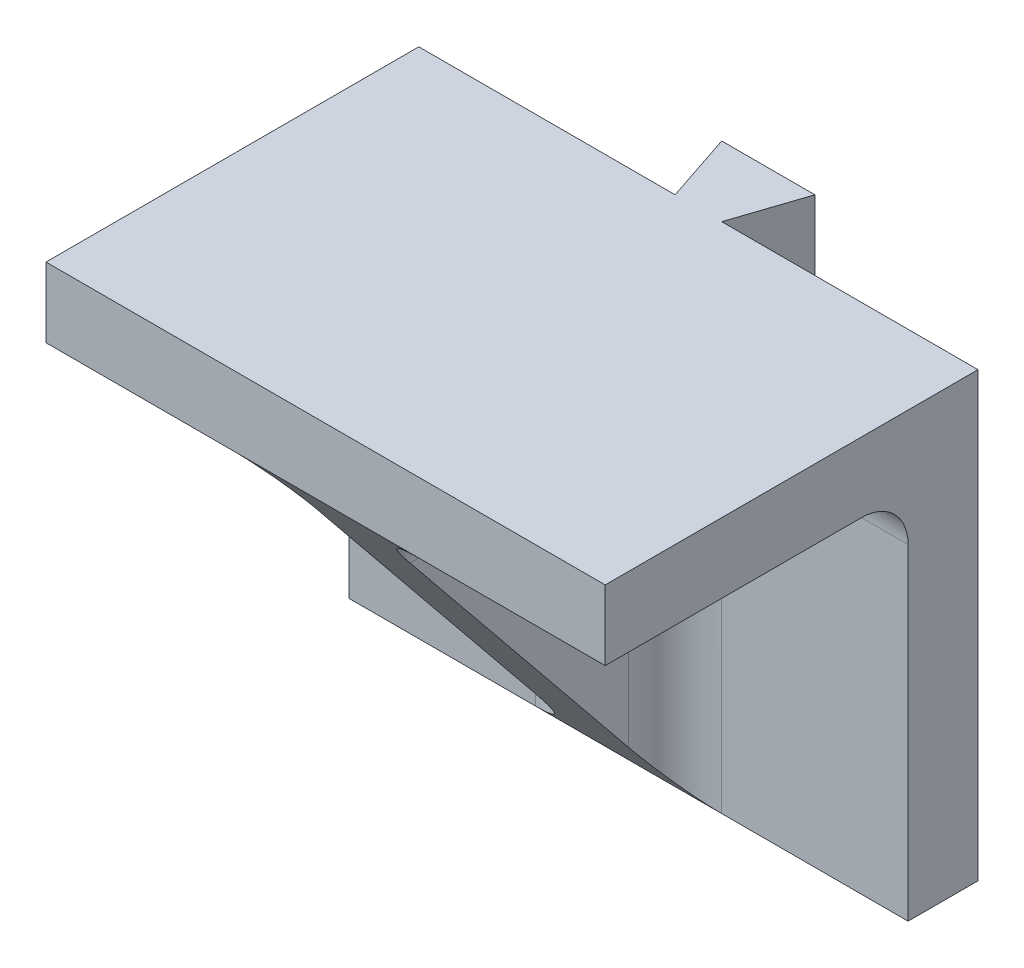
ISO-10303-21;
HEADER;
FILE_DESCRIPTION(('STEP AP214'),'2;1');
FILE_NAME('part.step','',(''),(''),'','','');
FILE_SCHEMA(('AUTOMOTIVE_DESIGN { 1 0 10303 214 1 1 1 1 }'));
ENDSEC;
DATA;
#1=APPLICATION_CONTEXT('core data for automotive mechanical design processes');
#2=APPLICATION_PROTOCOL_DEFINITION('international standard','automotive_design',2000,#1);
#3=PRODUCT_CONTEXT('',#1,'mechanical');
#4=PRODUCT('Part','Part','',(#3));
#5=PRODUCT_RELATED_PRODUCT_CATEGORY('part','',(#4));
#6=PRODUCT_DEFINITION_FORMATION('','',#4);
#7=PRODUCT_DEFINITION_CONTEXT('part definition',#1,'design');
#8=PRODUCT_DEFINITION('design','',#6,#7);
#9=PRODUCT_DEFINITION_SHAPE('','',#8);
#10=(LENGTH_UNIT() NAMED_UNIT(*) SI_UNIT(.MILLI.,.METRE.));
#11=(NAMED_UNIT(*) PLANE_ANGLE_UNIT() SI_UNIT($,.RADIAN.));
#12=(NAMED_UNIT(*) SI_UNIT($,.STERADIAN.) SOLID_ANGLE_UNIT());
#13=UNCERTAINTY_MEASURE_WITH_UNIT(LENGTH_MEASURE(1.E-05),#10,'distance_accuracy_value','');
#14=(GEOMETRIC_REPRESENTATION_CONTEXT(3) GLOBAL_UNCERTAINTY_ASSIGNED_CONTEXT((#13)) GLOBAL_UNIT_ASSIGNED_CONTEXT((#10,
#11,#12)) REPRESENTATION_CONTEXT('',''));
#15=CARTESIAN_POINT('',(0.,0.,0.));
#16=DIRECTION('',(0.,0.,1.));
#17=DIRECTION('',(1.,0.,0.));
#18=AXIS2_PLACEMENT_3D('',#15,#16,#17);
#19=CARTESIAN_POINT('',(-76.2,-19.05,0.));
#20=DIRECTION('',(0.,1.,0.));
#21=DIRECTION('',(0.,0.,1.));
#22=AXIS2_PLACEMENT_3D('',#19,#20,#21);
#23=PLANE('',#22);
#24=DIRECTION('',(1.,0.,0.));
#25=VECTOR('',#24,1.);
#26=CARTESIAN_POINT('',(-76.2,-19.05,101.6));
#27=LINE('',#26,#25);
#28=CARTESIAN_POINT('',(25.4,-19.05,101.6));
#29=VERTEX_POINT('',#28);
#30=CARTESIAN_POINT('',(76.2,-19.05,101.6));
#31=VERTEX_POINT('',#30);
#32=EDGE_CURVE('E213',#29,#31,#27,.T.);
#33=ORIENTED_EDGE('',*,*,#32,.F.);
#34=DIRECTION('',(0.,0.,1.));
#35=VECTOR('',#34,1.);
#36=CARTESIAN_POINT('',(25.4,-19.05,31.75));
#37=LINE('',#36,#35);
#38=CARTESIAN_POINT('',(25.4,-19.05,31.75));
#39=VERTEX_POINT('',#38);
#40=EDGE_CURVE('E268',#29,#39,#37,.F.);
#41=ORIENTED_EDGE('',*,*,#40,.T.);
#42=DIRECTION('',(1.,0.,0.));
#43=VECTOR('',#42,1.);
#44=CARTESIAN_POINT('',(-76.2,-19.05,31.75));
#45=LINE('',#44,#43);
#46=CARTESIAN_POINT('',(76.2,-19.05,31.75));
#47=VERTEX_POINT('',#46);
#48=EDGE_CURVE('E221',#39,#47,#45,.T.);
#49=ORIENTED_EDGE('',*,*,#48,.T.);
#50=DIRECTION('',(0.,0.,-1.));
#51=VECTOR('',#50,1.);
#52=CARTESIAN_POINT('',(76.2,-19.05,0.));
#53=LINE('',#52,#51);
#54=EDGE_CURVE('E232',#31,#47,#53,.T.);
#55=ORIENTED_EDGE('',*,*,#54,.F.);
#56=EDGE_LOOP('',(#33,#41,#49,#55));
#57=FACE_BOUND('',#56,.T.);
#58=ADVANCED_FACE('F33',(#57),#23,.F.);
#59=CARTESIAN_POINT('',(-76.2,-19.05,19.05));
#60=DIRECTION('',(0.,0.,1.));
#61=DIRECTION('',(1.,0.,0.));
#62=AXIS2_PLACEMENT_3D('',#59,#60,#61);
#63=PLANE('',#62);
#64=DIRECTION('',(1.,0.,0.));
#65=VECTOR('',#64,1.);
#66=CARTESIAN_POINT('',(-76.2,-31.75,19.05));
#67=LINE('',#66,#65);
#68=CARTESIAN_POINT('',(76.2,-31.75,19.05));
#69=VERTEX_POINT('',#68);
#70=CARTESIAN_POINT('',(25.4,-31.75,19.05));
#71=VERTEX_POINT('',#70);
#72=EDGE_CURVE('E275',#69,#71,#67,.F.);
#73=ORIENTED_EDGE('',*,*,#72,.T.);
#74=DIRECTION('',(0.,1.,0.));
#75=VECTOR('',#74,1.);
#76=CARTESIAN_POINT('',(25.4,-19.05,19.05));
#77=LINE('',#76,#75);
#78=CARTESIAN_POINT('',(25.4,-120.65,19.05));
#79=VERTEX_POINT('',#78);
#80=EDGE_CURVE('E295',#71,#79,#77,.F.);
#81=ORIENTED_EDGE('',*,*,#80,.T.);
#82=DIRECTION('',(1.,0.,0.));
#83=VECTOR('',#82,1.);
#84=CARTESIAN_POINT('',(-76.2,-120.65,19.05));
#85=LINE('',#84,#83);
#86=CARTESIAN_POINT('',(76.2,-120.65,19.05));
#87=VERTEX_POINT('',#86);
#88=EDGE_CURVE('E193',#79,#87,#85,.T.);
#89=ORIENTED_EDGE('',*,*,#88,.T.);
#90=DIRECTION('',(0.,-1.,0.));
#91=VECTOR('',#90,1.);
#92=CARTESIAN_POINT('',(76.2,-19.05,19.05));
#93=LINE('',#92,#91);
#94=EDGE_CURVE('E222',#69,#87,#93,.T.);
#95=ORIENTED_EDGE('',*,*,#94,.F.);
#96=EDGE_LOOP('',(#73,#81,#89,#95));
#97=FACE_BOUND('',#96,.T.);
#98=ADVANCED_FACE('F337',(#97),#63,.T.);
#99=CARTESIAN_POINT('',(-76.2,-31.75,31.75));
#100=DIRECTION('',(1.,0.,0.));
#101=DIRECTION('',(0.,0.,-1.));
#102=AXIS2_PLACEMENT_3D('',#99,#100,#101);
#103=CYLINDRICAL_SURFACE('',#102,12.7);
#104=ORIENTED_EDGE('',*,*,#48,.F.);
#105=CARTESIAN_POINT('',(25.4,-31.75,31.75));
#106=DIRECTION('',(1.,0.,0.));
#107=DIRECTION('',(0.,0.,-1.));
#108=AXIS2_PLACEMENT_3D('',#105,#106,#107);
#109=CIRCLE('',#108,12.7);
#110=EDGE_CURVE('E298',#39,#71,#109,.F.);
#111=ORIENTED_EDGE('',*,*,#110,.T.);
#112=ORIENTED_EDGE('',*,*,#72,.F.);
#113=CARTESIAN_POINT('',(76.2,-31.75,31.75));
#114=DIRECTION('',(1.,0.,0.));
#115=DIRECTION('',(0.,0.,-1.));
#116=AXIS2_PLACEMENT_3D('',#113,#114,#115);
#117=CIRCLE('',#116,12.7);
#118=EDGE_CURVE('E272',#47,#69,#117,.F.);
#119=ORIENTED_EDGE('',*,*,#118,.F.);
#120=EDGE_LOOP('',(#104,#111,#112,#119));
#121=FACE_BOUND('',#120,.T.);
#122=ADVANCED_FACE('F273',(#121),#103,.F.);
#123=CARTESIAN_POINT('',(-76.2,-19.05,0.));
#124=DIRECTION('',(0.,0.,-1.));
#125=DIRECTION('',(-1.,0.,0.));
#126=AXIS2_PLACEMENT_3D('',#123,#124,#125);
#127=PLANE('',#126);
#128=DIRECTION('',(1.,0.,0.));
#129=VECTOR('',#128,1.);
#130=CARTESIAN_POINT('',(-76.2,-120.65,0.));
#131=LINE('',#130,#129);
#132=CARTESIAN_POINT('',(6.35000000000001,-120.65,0.));
#133=VERTEX_POINT('',#132);
#134=CARTESIAN_POINT('',(76.2,-120.65,0.));
#135=VERTEX_POINT('',#134);
#136=EDGE_CURVE('E177',#133,#135,#131,.T.);
#137=ORIENTED_EDGE('',*,*,#136,.F.);
#138=DIRECTION('',(0.,1.,0.));
#139=VECTOR('',#138,1.);
#140=CARTESIAN_POINT('',(6.35000000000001,-120.65,0.));
#141=LINE('',#140,#139);
#142=CARTESIAN_POINT('',(6.34999999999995,0.,0.));
#143=VERTEX_POINT('',#142);
#144=EDGE_CURVE('E161',#133,#143,#141,.T.);
#145=ORIENTED_EDGE('',*,*,#144,.T.);
#146=DIRECTION('',(-1.,0.,0.));
#147=VECTOR('',#146,1.);
#148=CARTESIAN_POINT('',(-76.2,0.,0.));
#149=LINE('',#148,#147);
#150=CARTESIAN_POINT('',(76.2,0.,0.));
#151=VERTEX_POINT('',#150);
#152=EDGE_CURVE('E214',#151,#143,#149,.T.);
#153=ORIENTED_EDGE('',*,*,#152,.F.);
#154=DIRECTION('',(0.,1.,0.));
#155=VECTOR('',#154,1.);
#156=CARTESIAN_POINT('',(76.2,-19.05,0.));
#157=LINE('',#156,#155);
#158=EDGE_CURVE('E185',#135,#151,#157,.T.);
#159=ORIENTED_EDGE('',*,*,#158,.F.);
#160=EDGE_LOOP('',(#137,#145,#153,#159));
#161=FACE_BOUND('',#160,.T.);
#162=ADVANCED_FACE('F184',(#161),#127,.T.);
#163=CARTESIAN_POINT('',(-76.2,-19.05,0.));
#164=DIRECTION('',(-1.,0.,0.));
#165=DIRECTION('',(0.,0.,1.));
#166=AXIS2_PLACEMENT_3D('',#163,#164,#165);
#167=PLANE('',#166);
#168=DIRECTION('',(0.,0.,1.));
#169=VECTOR('',#168,1.);
#170=CARTESIAN_POINT('',(-76.2,0.,0.));
#171=LINE('',#170,#169);
#172=CARTESIAN_POINT('',(-76.2,0.,0.));
#173=VERTEX_POINT('',#172);
#174=CARTESIAN_POINT('',(-76.2,0.,101.6));
#175=VERTEX_POINT('',#174);
#176=EDGE_CURVE('E191',#173,#175,#171,.T.);
#177=ORIENTED_EDGE('',*,*,#176,.F.);
#178=DIRECTION('',(0.,1.,0.));
#179=VECTOR('',#178,1.);
#180=CARTESIAN_POINT('',(-76.2,-19.05,0.));
#181=LINE('',#180,#179);
#182=CARTESIAN_POINT('',(-76.2,-120.65,0.));
#183=VERTEX_POINT('',#182);
#184=EDGE_CURVE('E243',#183,#173,#181,.T.);
#185=ORIENTED_EDGE('',*,*,#184,.F.);
#186=DIRECTION('',(0.,0.,-1.));
#187=VECTOR('',#186,1.);
#188=CARTESIAN_POINT('',(-76.2,-120.65,0.));
#189=LINE('',#188,#187);
#190=CARTESIAN_POINT('',(-76.2,-120.65,19.05));
#191=VERTEX_POINT('',#190);
#192=EDGE_CURVE('E338',#191,#183,#189,.T.);
#193=ORIENTED_EDGE('',*,*,#192,.F.);
#194=DIRECTION('',(0.,-1.,0.));
#195=VECTOR('',#194,1.);
#196=CARTESIAN_POINT('',(-76.2,-19.05,19.05));
#197=LINE('',#196,#195);
#198=CARTESIAN_POINT('',(-76.2,-31.75,19.05));
#199=VERTEX_POINT('',#198);
#200=EDGE_CURVE('E227',#199,#191,#197,.T.);
#201=ORIENTED_EDGE('',*,*,#200,.F.);
#202=CARTESIAN_POINT('',(-76.2,-31.75,31.75));
#203=DIRECTION('',(-1.,0.,0.));
#204=DIRECTION('',(0.,0.,1.));
#205=AXIS2_PLACEMENT_3D('',#202,#203,#204);
#206=CIRCLE('',#205,12.7);
#207=CARTESIAN_POINT('',(-76.2,-19.05,31.75));
#208=VERTEX_POINT('',#207);
#209=EDGE_CURVE('E277',#199,#208,#206,.F.);
#210=ORIENTED_EDGE('',*,*,#209,.T.);
#211=DIRECTION('',(0.,0.,1.));
#212=VECTOR('',#211,1.);
#213=CARTESIAN_POINT('',(-76.2,-19.05,0.));
#214=LINE('',#213,#212);
#215=CARTESIAN_POINT('',(-76.2,-19.05,101.6));
#216=VERTEX_POINT('',#215);
#217=EDGE_CURVE('E210',#208,#216,#214,.T.);
#218=ORIENTED_EDGE('',*,*,#217,.T.);
#219=DIRECTION('',(0.,1.,0.));
#220=VECTOR('',#219,1.);
#221=CARTESIAN_POINT('',(-76.2,-19.05,101.6));
#222=LINE('',#221,#220);
#223=EDGE_CURVE('E249',#216,#175,#222,.T.);
#224=ORIENTED_EDGE('',*,*,#223,.T.);
#225=EDGE_LOOP('',(#177,#185,#193,#201,#210,#218,#224));
#226=FACE_BOUND('',#225,.T.);
#227=ADVANCED_FACE('F381',(#226),#167,.T.);
#228=DIRECTION('',(0.,1.,0.));
#229=VECTOR('',#228,1.);
#230=CARTESIAN_POINT('',(-6.34999999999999,-120.65,0.));
#231=LINE('',#230,#229);
#232=CARTESIAN_POINT('',(-6.34999999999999,-120.65,0.));
#233=VERTEX_POINT('',#232);
#234=CARTESIAN_POINT('',(-6.34999999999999,0.,0.));
#235=VERTEX_POINT('',#234);
#236=EDGE_CURVE('E226',#233,#235,#231,.T.);
#237=ORIENTED_EDGE('',*,*,#236,.F.);
#238=EDGE_CURVE('E187',#183,#233,#131,.T.);
#239=ORIENTED_EDGE('',*,*,#238,.F.);
#240=ORIENTED_EDGE('',*,*,#184,.T.);
#241=EDGE_CURVE('E237',#235,#173,#149,.T.);
#242=ORIENTED_EDGE('',*,*,#241,.F.);
#243=EDGE_LOOP('',(#237,#239,#240,#242));
#244=FACE_BOUND('',#243,.T.);
#245=ADVANCED_FACE('F377',(#244),#127,.T.);
#246=CARTESIAN_POINT('',(76.2,-19.05,0.));
#247=DIRECTION('',(1.,0.,0.));
#248=DIRECTION('',(0.,0.,-1.));
#249=AXIS2_PLACEMENT_3D('',#246,#247,#248);
#250=PLANE('',#249);
#251=DIRECTION('',(0.,0.,-1.));
#252=VECTOR('',#251,1.);
#253=CARTESIAN_POINT('',(76.2,0.,0.));
#254=LINE('',#253,#252);
#255=CARTESIAN_POINT('',(76.2,0.,101.6));
#256=VERTEX_POINT('',#255);
#257=EDGE_CURVE('E241',#256,#151,#254,.T.);
#258=ORIENTED_EDGE('',*,*,#257,.F.);
#259=DIRECTION('',(0.,1.,0.));
#260=VECTOR('',#259,1.);
#261=CARTESIAN_POINT('',(76.2,-19.05,101.6));
#262=LINE('',#261,#260);
#263=EDGE_CURVE('E248',#31,#256,#262,.T.);
#264=ORIENTED_EDGE('',*,*,#263,.F.);
#265=ORIENTED_EDGE('',*,*,#54,.T.);
#266=ORIENTED_EDGE('',*,*,#118,.T.);
#267=ORIENTED_EDGE('',*,*,#94,.T.);
#268=DIRECTION('',(0.,0.,-1.));
#269=VECTOR('',#268,1.);
#270=CARTESIAN_POINT('',(76.2,-120.65,0.));
#271=LINE('',#270,#269);
#272=EDGE_CURVE('E201',#87,#135,#271,.T.);
#273=ORIENTED_EDGE('',*,*,#272,.T.);
#274=ORIENTED_EDGE('',*,*,#158,.T.);
#275=EDGE_LOOP('',(#258,#264,#265,#266,#267,#273,#274));
#276=FACE_BOUND('',#275,.T.);
#277=ADVANCED_FACE('F262',(#276),#250,.T.);
#278=CARTESIAN_POINT('',(-76.2,-19.05,101.6));
#279=DIRECTION('',(0.,0.,1.));
#280=DIRECTION('',(1.,0.,0.));
#281=AXIS2_PLACEMENT_3D('',#278,#279,#280);
#282=PLANE('',#281);
#283=DIRECTION('',(1.,0.,0.));
#284=VECTOR('',#283,1.);
#285=CARTESIAN_POINT('',(-76.2,0.,101.6));
#286=LINE('',#285,#284);
#287=EDGE_CURVE('E378',#175,#256,#286,.T.);
#288=ORIENTED_EDGE('',*,*,#287,.F.);
#289=ORIENTED_EDGE('',*,*,#223,.F.);
#290=CARTESIAN_POINT('',(-25.4,-19.05,101.6));
#291=VERTEX_POINT('',#290);
#292=EDGE_CURVE('E207',#216,#291,#27,.T.);
#293=ORIENTED_EDGE('',*,*,#292,.T.);
#294=DIRECTION('',(-1.,0.,0.));
#295=VECTOR('',#294,1.);
#296=CARTESIAN_POINT('',(12.7,-19.05,101.6));
#297=LINE('',#296,#295);
#298=EDGE_CURVE('E50',#29,#291,#297,.T.);
#299=ORIENTED_EDGE('',*,*,#298,.F.);
#300=ORIENTED_EDGE('',*,*,#32,.T.);
#301=ORIENTED_EDGE('',*,*,#263,.T.);
#302=EDGE_LOOP('',(#288,#289,#293,#299,#300,#301));
#303=FACE_BOUND('',#302,.T.);
#304=ADVANCED_FACE('F259',(#303),#282,.T.);
#305=CARTESIAN_POINT('',(-25.4,-19.05,31.75));
#306=VERTEX_POINT('',#305);
#307=EDGE_CURVE('E217',#208,#306,#45,.T.);
#308=ORIENTED_EDGE('',*,*,#307,.T.);
#309=DIRECTION('',(0.,0.,1.));
#310=VECTOR('',#309,1.);
#311=CARTESIAN_POINT('',(-25.4,-19.05,0.));
#312=LINE('',#311,#310);
#313=EDGE_CURVE('E279',#306,#291,#312,.T.);
#314=ORIENTED_EDGE('',*,*,#313,.T.);
#315=ORIENTED_EDGE('',*,*,#292,.F.);
#316=ORIENTED_EDGE('',*,*,#217,.F.);
#317=EDGE_LOOP('',(#308,#314,#315,#316));
#318=FACE_BOUND('',#317,.T.);
#319=ADVANCED_FACE('F394',(#318),#23,.F.);
#320=CARTESIAN_POINT('',(-76.2,0.,0.));
#321=DIRECTION('',(0.,1.,0.));
#322=DIRECTION('',(0.,0.,1.));
#323=AXIS2_PLACEMENT_3D('',#320,#321,#322);
#324=PLANE('',#323);
#325=ORIENTED_EDGE('',*,*,#176,.T.);
#326=ORIENTED_EDGE('',*,*,#287,.T.);
#327=ORIENTED_EDGE('',*,*,#257,.T.);
#328=ORIENTED_EDGE('',*,*,#152,.T.);
#329=DIRECTION('',(0.316227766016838,0.,-0.948683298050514));
#330=VECTOR('',#329,1.);
#331=CARTESIAN_POINT('',(6.35000000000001,0.,0.));
#332=LINE('',#331,#330);
#333=CARTESIAN_POINT('',(12.7,0.,-19.05));
#334=VERTEX_POINT('',#333);
#335=EDGE_CURVE('E166',#143,#334,#332,.T.);
#336=ORIENTED_EDGE('',*,*,#335,.T.);
#337=DIRECTION('',(-1.,0.,0.));
#338=VECTOR('',#337,1.);
#339=CARTESIAN_POINT('',(12.7,0.,-19.05));
#340=LINE('',#339,#338);
#341=CARTESIAN_POINT('',(-12.7,0.,-19.05));
#342=VERTEX_POINT('',#341);
#343=EDGE_CURVE('E355',#334,#342,#340,.T.);
#344=ORIENTED_EDGE('',*,*,#343,.T.);
#345=DIRECTION('',(0.316227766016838,0.,0.948683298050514));
#346=VECTOR('',#345,1.);
#347=CARTESIAN_POINT('',(-6.34999999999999,0.,0.));
#348=LINE('',#347,#346);
#349=EDGE_CURVE('E182',#342,#235,#348,.T.);
#350=ORIENTED_EDGE('',*,*,#349,.T.);
#351=ORIENTED_EDGE('',*,*,#241,.T.);
#352=EDGE_LOOP('',(#325,#326,#327,#328,#336,#344,#350,#351));
#353=FACE_BOUND('',#352,.T.);
#354=ADVANCED_FACE('F365',(#353),#324,.T.);
#355=CARTESIAN_POINT('',(-76.2,-120.65,0.));
#356=DIRECTION('',(0.,-1.,0.));
#357=DIRECTION('',(0.,0.,-1.));
#358=AXIS2_PLACEMENT_3D('',#355,#356,#357);
#359=PLANE('',#358);
#360=ORIENTED_EDGE('',*,*,#272,.F.);
#361=ORIENTED_EDGE('',*,*,#88,.F.);
#362=DIRECTION('',(-1.,0.,0.));
#363=VECTOR('',#362,1.);
#364=CARTESIAN_POINT('',(12.7,-120.65,19.05));
#365=LINE('',#364,#363);
#366=CARTESIAN_POINT('',(-25.4,-120.65,19.05));
#367=VERTEX_POINT('',#366);
#368=EDGE_CURVE('E58',#79,#367,#365,.T.);
#369=ORIENTED_EDGE('',*,*,#368,.T.);
#370=EDGE_CURVE('E188',#191,#367,#85,.T.);
#371=ORIENTED_EDGE('',*,*,#370,.F.);
#372=ORIENTED_EDGE('',*,*,#192,.T.);
#373=ORIENTED_EDGE('',*,*,#238,.T.);
#374=DIRECTION('',(0.316227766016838,0.,0.948683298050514));
#375=VECTOR('',#374,1.);
#376=CARTESIAN_POINT('',(-6.34999999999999,-120.65,0.));
#377=LINE('',#376,#375);
#378=CARTESIAN_POINT('',(-12.7,-120.65,-19.05));
#379=VERTEX_POINT('',#378);
#380=EDGE_CURVE('E172',#379,#233,#377,.T.);
#381=ORIENTED_EDGE('',*,*,#380,.F.);
#382=DIRECTION('',(-1.,0.,0.));
#383=VECTOR('',#382,1.);
#384=CARTESIAN_POINT('',(12.7,-120.65,-19.05));
#385=LINE('',#384,#383);
#386=CARTESIAN_POINT('',(12.7,-120.65,-19.05));
#387=VERTEX_POINT('',#386);
#388=EDGE_CURVE('E181',#387,#379,#385,.T.);
#389=ORIENTED_EDGE('',*,*,#388,.F.);
#390=DIRECTION('',(0.316227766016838,0.,-0.948683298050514));
#391=VECTOR('',#390,1.);
#392=CARTESIAN_POINT('',(6.35000000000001,-120.65,0.));
#393=LINE('',#392,#391);
#394=EDGE_CURVE('E164',#133,#387,#393,.T.);
#395=ORIENTED_EDGE('',*,*,#394,.F.);
#396=ORIENTED_EDGE('',*,*,#136,.T.);
#397=EDGE_LOOP('',(#360,#361,#369,#371,#372,#373,#381,#389,#395,#396));
#398=FACE_BOUND('',#397,.T.);
#399=ADVANCED_FACE('F176',(#398),#359,.T.);
#400=ORIENTED_EDGE('',*,*,#370,.T.);
#401=DIRECTION('',(0.,1.,0.));
#402=VECTOR('',#401,1.);
#403=CARTESIAN_POINT('',(-25.4,-31.75,19.05));
#404=LINE('',#403,#402);
#405=CARTESIAN_POINT('',(-25.4,-31.75,19.05));
#406=VERTEX_POINT('',#405);
#407=EDGE_CURVE('E300',#367,#406,#404,.T.);
#408=ORIENTED_EDGE('',*,*,#407,.T.);
#409=EDGE_CURVE('E220',#406,#199,#67,.F.);
#410=ORIENTED_EDGE('',*,*,#409,.T.);
#411=ORIENTED_EDGE('',*,*,#200,.T.);
#412=EDGE_LOOP('',(#400,#408,#410,#411));
#413=FACE_BOUND('',#412,.T.);
#414=ADVANCED_FACE('F435',(#413),#63,.T.);
#415=CARTESIAN_POINT('',(-6.34999999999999,-120.65,0.));
#416=DIRECTION('',(-0.948683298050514,0.,0.316227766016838));
#417=DIRECTION('',(0.316227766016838,0.,0.948683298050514));
#418=AXIS2_PLACEMENT_3D('',#415,#416,#417);
#419=PLANE('',#418);
#420=ORIENTED_EDGE('',*,*,#349,.F.);
#421=DIRECTION('',(0.,1.,0.));
#422=VECTOR('',#421,1.);
#423=CARTESIAN_POINT('',(-12.7,-120.65,-19.05));
#424=LINE('',#423,#422);
#425=EDGE_CURVE('E351',#379,#342,#424,.T.);
#426=ORIENTED_EDGE('',*,*,#425,.F.);
#427=ORIENTED_EDGE('',*,*,#380,.T.);
#428=ORIENTED_EDGE('',*,*,#236,.T.);
#429=EDGE_LOOP('',(#420,#426,#427,#428));
#430=FACE_BOUND('',#429,.T.);
#431=ADVANCED_FACE('F373',(#430),#419,.T.);
#432=CARTESIAN_POINT('',(12.7,-120.65,-19.05));
#433=DIRECTION('',(0.,0.,-1.));
#434=DIRECTION('',(-1.,0.,0.));
#435=AXIS2_PLACEMENT_3D('',#432,#433,#434);
#436=PLANE('',#435);
#437=ORIENTED_EDGE('',*,*,#343,.F.);
#438=DIRECTION('',(0.,1.,0.));
#439=VECTOR('',#438,1.);
#440=CARTESIAN_POINT('',(12.7,-120.65,-19.05));
#441=LINE('',#440,#439);
#442=EDGE_CURVE('E171',#387,#334,#441,.T.);
#443=ORIENTED_EDGE('',*,*,#442,.F.);
#444=ORIENTED_EDGE('',*,*,#388,.T.);
#445=ORIENTED_EDGE('',*,*,#425,.T.);
#446=EDGE_LOOP('',(#437,#443,#444,#445));
#447=FACE_BOUND('',#446,.T.);
#448=ADVANCED_FACE('F360',(#447),#436,.T.);
#449=CARTESIAN_POINT('',(6.35000000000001,-120.65,0.));
#450=DIRECTION('',(0.948683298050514,0.,0.316227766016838));
#451=DIRECTION('',(0.316227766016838,0.,-0.948683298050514));
#452=AXIS2_PLACEMENT_3D('',#449,#450,#451);
#453=PLANE('',#452);
#454=ORIENTED_EDGE('',*,*,#335,.F.);
#455=ORIENTED_EDGE('',*,*,#144,.F.);
#456=ORIENTED_EDGE('',*,*,#394,.T.);
#457=ORIENTED_EDGE('',*,*,#442,.T.);
#458=EDGE_LOOP('',(#454,#455,#456,#457));
#459=FACE_BOUND('',#458,.T.);
#460=ADVANCED_FACE('F163',(#459),#453,.T.);
#461=ORIENTED_EDGE('',*,*,#409,.F.);
#462=CARTESIAN_POINT('',(-25.4,-31.75,31.75));
#463=DIRECTION('',(1.,0.,0.));
#464=DIRECTION('',(0.,0.,-1.));
#465=AXIS2_PLACEMENT_3D('',#462,#463,#464);
#466=CIRCLE('',#465,12.7);
#467=EDGE_CURVE('E288',#406,#306,#466,.T.);
#468=ORIENTED_EDGE('',*,*,#467,.T.);
#469=ORIENTED_EDGE('',*,*,#307,.F.);
#470=ORIENTED_EDGE('',*,*,#209,.F.);
#471=EDGE_LOOP('',(#461,#468,#469,#470));
#472=FACE_BOUND('',#471,.T.);
#473=ADVANCED_FACE('F389',(#472),#103,.F.);
#474=CARTESIAN_POINT('',(12.7,-19.05,19.05));
#475=DIRECTION('',(-1.,0.,0.));
#476=DIRECTION('',(0.,0.,1.));
#477=AXIS2_PLACEMENT_3D('',#474,#475,#476);
#478=PLANE('',#477);
#479=CARTESIAN_POINT('',(12.7,-50.8,50.8));
#480=DIRECTION('',(1.,0.,0.));
#481=DIRECTION('',(0.,0.,-1.));
#482=AXIS2_PLACEMENT_3D('',#479,#480,#481);
#483=CIRCLE('',#482,9.525);
#484=CARTESIAN_POINT('',(12.7,-50.8,41.275));
#485=VERTEX_POINT('',#484);
#486=EDGE_CURVE('E410',#485,#485,#483,.T.);
#487=ORIENTED_EDGE('',*,*,#486,.F.);
#488=EDGE_LOOP('',(#487));
#489=FACE_BOUND('',#488,.T.);
#490=DIRECTION('',(0.,-0.776114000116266,-0.630592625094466));
#491=VECTOR('',#490,1.);
#492=CARTESIAN_POINT('',(12.7,-19.05,101.6));
#493=LINE('',#492,#491);
#494=CARTESIAN_POINT('',(12.7,-31.75,91.28125));
#495=VERTEX_POINT('',#494);
#496=CARTESIAN_POINT('',(12.7,-105.019230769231,31.75));
#497=VERTEX_POINT('',#496);
#498=EDGE_CURVE('E331',#495,#497,#493,.T.);
#499=ORIENTED_EDGE('',*,*,#498,.T.);
#500=DIRECTION('',(0.,1.,0.));
#501=VECTOR('',#500,1.);
#502=CARTESIAN_POINT('',(12.7,-19.05,31.75));
#503=LINE('',#502,#501);
#504=CARTESIAN_POINT('',(12.7,-31.75,31.75));
#505=VERTEX_POINT('',#504);
#506=EDGE_CURVE('E292',#497,#505,#503,.T.);
#507=ORIENTED_EDGE('',*,*,#506,.T.);
#508=DIRECTION('',(0.,0.,1.));
#509=VECTOR('',#508,1.);
#510=CARTESIAN_POINT('',(12.7,-31.75,101.6));
#511=LINE('',#510,#509);
#512=EDGE_CURVE('E290',#505,#495,#511,.T.);
#513=ORIENTED_EDGE('',*,*,#512,.T.);
#514=EDGE_LOOP('',(#499,#507,#513));
#515=FACE_BOUND('',#514,.T.);
#516=ADVANCED_FACE('F330',(#489,#515),#478,.F.);
#517=CARTESIAN_POINT('',(-12.7,-19.05,19.05));
#518=DIRECTION('',(-1.,0.,0.));
#519=DIRECTION('',(0.,0.,1.));
#520=AXIS2_PLACEMENT_3D('',#517,#518,#519);
#521=PLANE('',#520);
#522=CARTESIAN_POINT('',(-12.7,-50.8,50.8));
#523=DIRECTION('',(-1.,0.,0.));
#524=DIRECTION('',(0.,0.,1.));
#525=AXIS2_PLACEMENT_3D('',#522,#523,#524);
#526=CIRCLE('',#525,9.525);
#527=CARTESIAN_POINT('',(-12.7,-50.8,60.325));
#528=VERTEX_POINT('',#527);
#529=EDGE_CURVE('E37',#528,#528,#526,.T.);
#530=ORIENTED_EDGE('',*,*,#529,.F.);
#531=EDGE_LOOP('',(#530));
#532=FACE_BOUND('',#531,.T.);
#533=DIRECTION('',(0.,-0.776114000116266,-0.630592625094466));
#534=VECTOR('',#533,1.);
#535=CARTESIAN_POINT('',(-12.7,-19.05,101.6));
#536=LINE('',#535,#534);
#537=CARTESIAN_POINT('',(-12.7,-31.75,91.28125));
#538=VERTEX_POINT('',#537);
#539=CARTESIAN_POINT('',(-12.7,-105.019230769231,31.75));
#540=VERTEX_POINT('',#539);
#541=EDGE_CURVE('E316',#538,#540,#536,.T.);
#542=ORIENTED_EDGE('',*,*,#541,.F.);
#543=DIRECTION('',(0.,0.,1.));
#544=VECTOR('',#543,1.);
#545=CARTESIAN_POINT('',(-12.7,-31.75,19.05));
#546=LINE('',#545,#544);
#547=CARTESIAN_POINT('',(-12.7,-31.75,31.75));
#548=VERTEX_POINT('',#547);
#549=EDGE_CURVE('E286',#538,#548,#546,.F.);
#550=ORIENTED_EDGE('',*,*,#549,.T.);
#551=DIRECTION('',(0.,1.,0.));
#552=VECTOR('',#551,1.);
#553=CARTESIAN_POINT('',(-12.7,-120.65,31.75));
#554=LINE('',#553,#552);
#555=EDGE_CURVE('E284',#548,#540,#554,.F.);
#556=ORIENTED_EDGE('',*,*,#555,.T.);
#557=EDGE_LOOP('',(#542,#550,#556));
#558=FACE_BOUND('',#557,.T.);
#559=ADVANCED_FACE('F406',(#532,#558),#521,.T.);
#560=CARTESIAN_POINT('',(12.7,-19.05,101.6));
#561=DIRECTION('',(0.,0.630592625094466,-0.776114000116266));
#562=DIRECTION('',(0.,0.776114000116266,0.630592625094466));
#563=AXIS2_PLACEMENT_3D('',#560,#561,#562);
#564=PLANE('',#563);
#565=ORIENTED_EDGE('',*,*,#298,.T.);
#566=CARTESIAN_POINT('',(-25.4,-31.75,91.28125));
#567=DIRECTION('',(0.,0.630592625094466,-0.776114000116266));
#568=DIRECTION('',(0.,0.776114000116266,0.630592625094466));
#569=AXIS2_PLACEMENT_3D('',#566,#567,#568);
#570=ELLIPSE('',#569,16.3635754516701,12.7);
#571=EDGE_CURVE('E303',#291,#538,#570,.T.);
#572=ORIENTED_EDGE('',*,*,#571,.T.);
#573=ORIENTED_EDGE('',*,*,#541,.T.);
#574=CARTESIAN_POINT('',(-25.4,-105.019230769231,31.75));
#575=DIRECTION('',(0.,0.630592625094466,-0.776114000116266));
#576=DIRECTION('',(0.,-0.776114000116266,-0.630592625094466));
#577=AXIS2_PLACEMENT_3D('',#574,#575,#576);
#578=ELLIPSE('',#577,20.1397851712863,12.7);
#579=EDGE_CURVE('E42',#540,#367,#578,.T.);
#580=ORIENTED_EDGE('',*,*,#579,.T.);
#581=ORIENTED_EDGE('',*,*,#368,.F.);
#582=CARTESIAN_POINT('',(25.4,-105.019230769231,31.75));
#583=DIRECTION('',(0.,0.630592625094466,-0.776114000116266));
#584=DIRECTION('',(0.,0.776114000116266,0.630592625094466));
#585=AXIS2_PLACEMENT_3D('',#582,#583,#584);
#586=ELLIPSE('',#585,20.1397851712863,12.7);
#587=EDGE_CURVE('E305',#79,#497,#586,.T.);
#588=ORIENTED_EDGE('',*,*,#587,.T.);
#589=ORIENTED_EDGE('',*,*,#498,.F.);
#590=CARTESIAN_POINT('',(25.4,-31.75,91.28125));
#591=DIRECTION('',(0.,0.630592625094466,-0.776114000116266));
#592=DIRECTION('',(0.,-0.776114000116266,-0.630592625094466));
#593=AXIS2_PLACEMENT_3D('',#590,#591,#592);
#594=ELLIPSE('',#593,16.3635754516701,12.7);
#595=EDGE_CURVE('E11',#495,#29,#594,.T.);
#596=ORIENTED_EDGE('',*,*,#595,.T.);
#597=EDGE_LOOP('',(#565,#572,#573,#580,#581,#588,#589,#596));
#598=FACE_BOUND('',#597,.T.);
#599=ADVANCED_FACE('F403',(#598),#564,.F.);
#600=CARTESIAN_POINT('',(-25.4,-19.05,31.75));
#601=DIRECTION('',(0.,-1.,0.));
#602=DIRECTION('',(0.,0.,-1.));
#603=AXIS2_PLACEMENT_3D('',#600,#601,#602);
#604=CYLINDRICAL_SURFACE('',#603,12.7);
#605=CARTESIAN_POINT('',(-25.4,-31.75,31.75));
#606=DIRECTION('',(0.,-1.,0.));
#607=DIRECTION('',(0.,0.,-1.));
#608=AXIS2_PLACEMENT_3D('',#605,#606,#607);
#609=CIRCLE('',#608,12.7);
#610=EDGE_CURVE('E312',#406,#548,#609,.T.);
#611=ORIENTED_EDGE('',*,*,#610,.F.);
#612=ORIENTED_EDGE('',*,*,#407,.F.);
#613=ORIENTED_EDGE('',*,*,#579,.F.);
#614=ORIENTED_EDGE('',*,*,#555,.F.);
#615=EDGE_LOOP('',(#611,#612,#613,#614));
#616=FACE_BOUND('',#615,.T.);
#617=ADVANCED_FACE('F425',(#616),#604,.F.);
#618=CARTESIAN_POINT('',(-25.4,-31.75,31.75));
#619=DIRECTION('',(0.,0.,1.));
#620=DIRECTION('',(1.,0.,0.));
#621=AXIS2_PLACEMENT_3D('',#618,#619,#620);
#622=SPHERICAL_SURFACE('',#621,12.7);
#623=ORIENTED_EDGE('',*,*,#467,.F.);
#624=ORIENTED_EDGE('',*,*,#610,.T.);
#625=CARTESIAN_POINT('',(-25.4,-31.75,31.75));
#626=DIRECTION('',(0.,0.,-1.));
#627=DIRECTION('',(-1.,0.,0.));
#628=AXIS2_PLACEMENT_3D('',#625,#626,#627);
#629=CIRCLE('',#628,12.7);
#630=EDGE_CURVE('E309',#306,#548,#629,.T.);
#631=ORIENTED_EDGE('',*,*,#630,.F.);
#632=EDGE_LOOP('',(#623,#624,#631));
#633=FACE_BOUND('',#632,.T.);
#634=ADVANCED_FACE('F397',(#633),#622,.F.);
#635=CARTESIAN_POINT('',(-25.4,-31.75,0.));
#636=DIRECTION('',(0.,0.,1.));
#637=DIRECTION('',(1.,0.,0.));
#638=AXIS2_PLACEMENT_3D('',#635,#636,#637);
#639=CYLINDRICAL_SURFACE('',#638,12.7);
#640=ORIENTED_EDGE('',*,*,#630,.T.);
#641=ORIENTED_EDGE('',*,*,#549,.F.);
#642=ORIENTED_EDGE('',*,*,#571,.F.);
#643=ORIENTED_EDGE('',*,*,#313,.F.);
#644=EDGE_LOOP('',(#640,#641,#642,#643));
#645=FACE_BOUND('',#644,.T.);
#646=ADVANCED_FACE('F400',(#645),#639,.F.);
#647=CARTESIAN_POINT('',(25.4,-31.75,19.05));
#648=DIRECTION('',(0.,0.,-1.));
#649=DIRECTION('',(-1.,0.,0.));
#650=AXIS2_PLACEMENT_3D('',#647,#648,#649);
#651=CYLINDRICAL_SURFACE('',#650,12.7);
#652=CARTESIAN_POINT('',(25.4,-31.75,31.75));
#653=DIRECTION('',(0.,0.,1.));
#654=DIRECTION('',(1.,0.,0.));
#655=AXIS2_PLACEMENT_3D('',#652,#653,#654);
#656=CIRCLE('',#655,12.7);
#657=EDGE_CURVE('E313',#39,#505,#656,.T.);
#658=ORIENTED_EDGE('',*,*,#657,.F.);
#659=ORIENTED_EDGE('',*,*,#40,.F.);
#660=ORIENTED_EDGE('',*,*,#595,.F.);
#661=ORIENTED_EDGE('',*,*,#512,.F.);
#662=EDGE_LOOP('',(#658,#659,#660,#661));
#663=FACE_BOUND('',#662,.T.);
#664=ADVANCED_FACE('F35',(#663),#651,.F.);
#665=CARTESIAN_POINT('',(25.4,-31.75,31.75));
#666=DIRECTION('',(0.,0.,1.));
#667=DIRECTION('',(1.,0.,0.));
#668=AXIS2_PLACEMENT_3D('',#665,#666,#667);
#669=SPHERICAL_SURFACE('',#668,12.7);
#670=ORIENTED_EDGE('',*,*,#110,.F.);
#671=ORIENTED_EDGE('',*,*,#657,.T.);
#672=CARTESIAN_POINT('',(25.4,-31.75,31.75));
#673=DIRECTION('',(0.,1.,0.));
#674=DIRECTION('',(0.,0.,1.));
#675=AXIS2_PLACEMENT_3D('',#672,#673,#674);
#676=CIRCLE('',#675,12.7);
#677=EDGE_CURVE('E317',#71,#505,#676,.T.);
#678=ORIENTED_EDGE('',*,*,#677,.F.);
#679=EDGE_LOOP('',(#670,#671,#678));
#680=FACE_BOUND('',#679,.T.);
#681=ADVANCED_FACE('F323',(#680),#669,.F.);
#682=CARTESIAN_POINT('',(25.4,-19.05,31.75));
#683=DIRECTION('',(0.,1.,0.));
#684=DIRECTION('',(0.,0.,1.));
#685=AXIS2_PLACEMENT_3D('',#682,#683,#684);
#686=CYLINDRICAL_SURFACE('',#685,12.7);
#687=ORIENTED_EDGE('',*,*,#587,.F.);
#688=ORIENTED_EDGE('',*,*,#80,.F.);
#689=ORIENTED_EDGE('',*,*,#677,.T.);
#690=ORIENTED_EDGE('',*,*,#506,.F.);
#691=EDGE_LOOP('',(#687,#688,#689,#690));
#692=FACE_BOUND('',#691,.T.);
#693=ADVANCED_FACE('F334',(#692),#686,.F.);
#694=CARTESIAN_POINT('',(-76.200025,-50.8,50.8));
#695=DIRECTION('',(1.,0.,0.));
#696=DIRECTION('',(0.,0.,-1.));
#697=AXIS2_PLACEMENT_3D('',#694,#695,#696);
#698=CYLINDRICAL_SURFACE('',#697,9.525);
#699=ORIENTED_EDGE('',*,*,#529,.T.);
#700=EDGE_LOOP('',(#699));
#701=FACE_BOUND('',#700,.T.);
#702=ORIENTED_EDGE('',*,*,#486,.T.);
#703=EDGE_LOOP('',(#702));
#704=FACE_BOUND('',#703,.T.);
#705=ADVANCED_FACE('F417',(#701,#704),#698,.F.);
#706=CLOSED_SHELL('',(#58,#98,#122,#162,#227,#245,#277,#304,#319,#354,#399,#414,#431,#448,#460,
#473,#516,#559,#599,#617,#634,#646,#664,#681,#693,#705));
#707=MANIFOLD_SOLID_BREP('B2',#706);
#708=ADVANCED_BREP_SHAPE_REPRESENTATION('',(#18,#707),#14);
#709=SHAPE_DEFINITION_REPRESENTATION(#9,#708);
ENDSEC;
END-ISO-10303-21;
